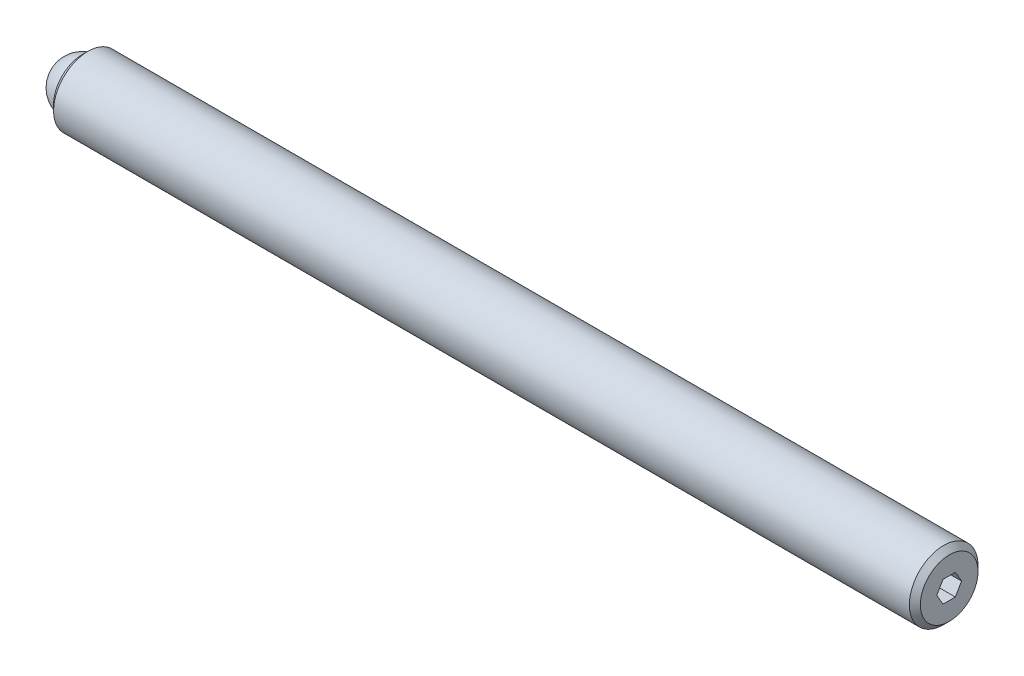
from build123d import *

# Parameters (mm, degrees)
SKETCH2_R           = 3.175
BOSS_EXTRUDE1_DEPTH = 80.16875
CHAMFER1_SIZE       = 0.508
CHAMFER2_SIZE       = 0.508
CUT_EXTRUDE2_DEPTH  = 2.286
SKETCH3_R           = 2.38125
CUT_EXTRUDE3_DEPTH  = 1.984375


with BuildPart() as part:
    # Sketch2 → Boss-Extrude1 (new body)
    with BuildSketch(Plane(origin=(0, 0, 0), x_dir=(0, 0, -1), z_dir=(1, 0, 0))):
        with Locations(Location((0, 0, 0), (0, 0, 180))):
            Circle(SKETCH2_R)
    extrude(amount=BOSS_EXTRUDE1_DEPTH)

    # Chamfer1
    chamfer1_edges = [part.edges().sort_by_distance(p)[0] for p in [
        (0, 0, -3.175),
    ]]
    chamfer(chamfer1_edges, length=CHAMFER1_SIZE)

    # Chamfer2
    chamfer2_edges = [part.edges().sort_by_distance(p)[0] for p in [
        (80.16875, 0, -3.175),
    ]]
    chamfer(chamfer2_edges, length=CHAMFER2_SIZE)

    # Sketch4 → Cut-Extrude2 (cut)
    with BuildSketch(Plane(origin=(80.16875, 0, 0), x_dir=(0, 0, -1), z_dir=(1, 0, 0))):
        Polygon((1.14567944, 0), (0.57283972, 0.9921875), (-0.57283972, 0.9921875), (-1.14567944, 0), (-0.57283972, -0.9921875), (0.57283972, -0.9921875), align=None)
    extrude(amount=-CUT_EXTRUDE2_DEPTH, mode=Mode.SUBTRACT)

    # Sketch3 → Cut-Extrude3 (cut)
    with BuildSketch(Plane.ZY):
        Circle(SKETCH3_R)
    extrude(amount=-CUT_EXTRUDE3_DEPTH, mode=Mode.SUBTRACT)


with BuildPart() as body_2:
    # Sketch5 → Revolve1 (revolve)
    with BuildSketch(Plane.ZY):
        with BuildLine():
            Line((0, 0), (0, -2.38125))
            ThreePointArc((0, -2.38125), (-2.38125, 0), (0, 2.38125))
            Line((0, 2.38125), (0, 0))
        make_face()
    revolve(axis=Axis((0, 0, 0), (0, 1, 0)))


solid = Compound([part.part, body_2.part])
